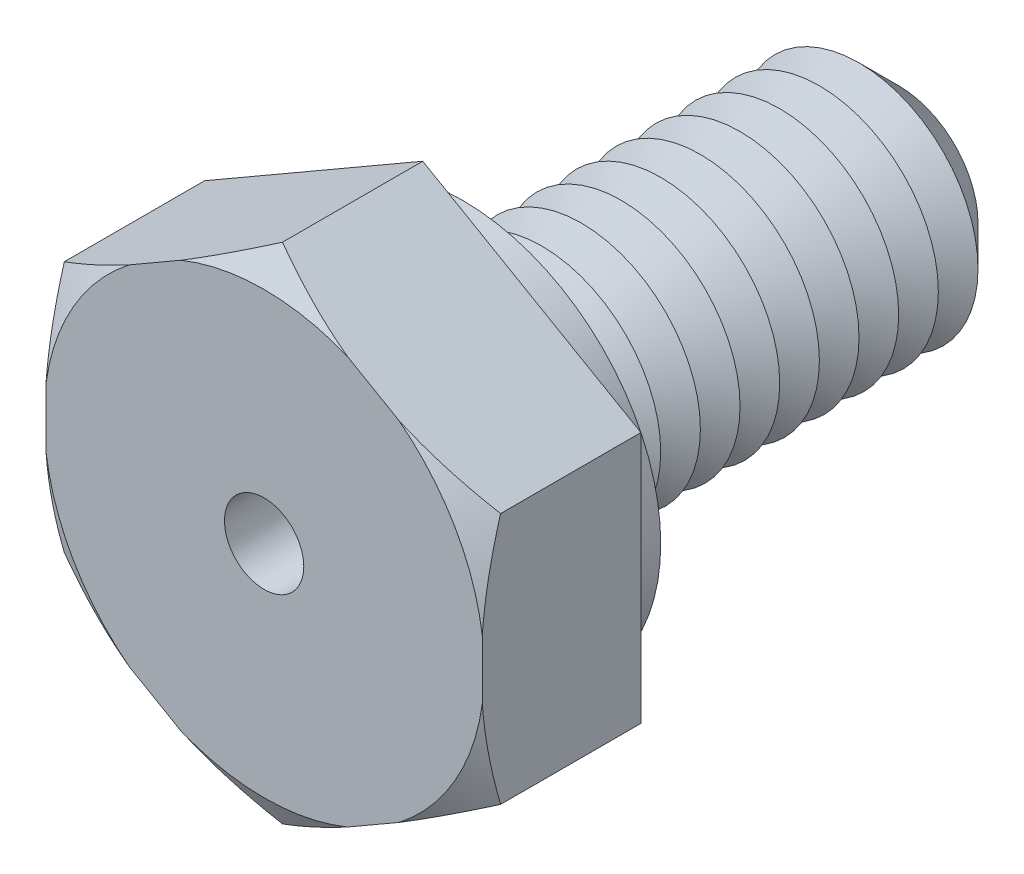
ISO-10303-21;
HEADER;
FILE_DESCRIPTION(('STEP AP214'),'2;1');
FILE_NAME('part.step','',(''),(''),'','','');
FILE_SCHEMA(('AUTOMOTIVE_DESIGN { 1 0 10303 214 1 1 1 1 }'));
ENDSEC;
DATA;
#1=APPLICATION_CONTEXT('core data for automotive mechanical design processes');
#2=APPLICATION_PROTOCOL_DEFINITION('international standard','automotive_design',2000,#1);
#3=PRODUCT_CONTEXT('',#1,'mechanical');
#4=PRODUCT('Part','Part','',(#3));
#5=PRODUCT_RELATED_PRODUCT_CATEGORY('part','',(#4));
#6=PRODUCT_DEFINITION_FORMATION('','',#4);
#7=PRODUCT_DEFINITION_CONTEXT('part definition',#1,'design');
#8=PRODUCT_DEFINITION('design','',#6,#7);
#9=PRODUCT_DEFINITION_SHAPE('','',#8);
#10=(LENGTH_UNIT() NAMED_UNIT(*) SI_UNIT(.MILLI.,.METRE.));
#11=(NAMED_UNIT(*) PLANE_ANGLE_UNIT() SI_UNIT($,.RADIAN.));
#12=(NAMED_UNIT(*) SI_UNIT($,.STERADIAN.) SOLID_ANGLE_UNIT());
#13=UNCERTAINTY_MEASURE_WITH_UNIT(LENGTH_MEASURE(1.E-05),#10,'distance_accuracy_value','');
#14=(GEOMETRIC_REPRESENTATION_CONTEXT(3) GLOBAL_UNCERTAINTY_ASSIGNED_CONTEXT((#13)) GLOBAL_UNIT_ASSIGNED_CONTEXT((#10,
#11,#12)) REPRESENTATION_CONTEXT('',''));
#15=CARTESIAN_POINT('',(0.,0.,0.));
#16=DIRECTION('',(0.,0.,1.));
#17=DIRECTION('',(1.,0.,0.));
#18=AXIS2_PLACEMENT_3D('',#15,#16,#17);
#19=CARTESIAN_POINT('',(2.75,1.58771324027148,2.));
#20=DIRECTION('',(-0.5,-0.866025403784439,0.));
#21=DIRECTION('',(0.866025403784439,-0.5,0.));
#22=AXIS2_PLACEMENT_3D('',#19,#20,#21);
#23=PLANE('',#22);
#24=CARTESIAN_POINT('',(4.66048793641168,0.484692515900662,0.897146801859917));
#25=CARTESIAN_POINT('',(4.57407924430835,0.53458059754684,0.94377821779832));
#26=CARTESIAN_POINT('',(4.48746398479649,0.584587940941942,0.989906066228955));
#27=CARTESIAN_POINT('',(4.31373297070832,0.684891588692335,1.08092005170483));
#28=CARTESIAN_POINT('',(4.22661715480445,0.735187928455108,1.12580603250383));
#29=CARTESIAN_POINT('',(4.05153903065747,0.836269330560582,1.21423144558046));
#30=CARTESIAN_POINT('',(3.96357490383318,0.887055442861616,1.25776609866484));
#31=CARTESIAN_POINT('',(3.78698874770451,0.989007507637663,1.34300583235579));
#32=CARTESIAN_POINT('',(3.69836673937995,1.04017344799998,1.38471097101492));
#33=CARTESIAN_POINT('',(3.42682968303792,1.196945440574,1.50858888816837));
#34=CARTESIAN_POINT('',(3.2426849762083,1.30326143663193,1.58723569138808));
#35=CARTESIAN_POINT('',(2.87039319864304,1.51820419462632,1.73037556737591));
#36=CARTESIAN_POINT('',(2.68225085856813,1.62682822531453,1.7948844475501));
#37=CARTESIAN_POINT('',(2.36072167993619,1.81246318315,1.88587189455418));
#38=CARTESIAN_POINT('',(2.22854222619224,1.88877702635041,1.91793719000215));
#39=CARTESIAN_POINT('',(1.9623222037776,2.04247922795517,1.96931401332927));
#40=CARTESIAN_POINT('',(1.82828230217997,2.11986720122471,1.98862999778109));
#41=CARTESIAN_POINT('',(1.56075616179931,2.27432349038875,2.0122791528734));
#42=CARTESIAN_POINT('',(1.42728171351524,2.35138499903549,2.01678452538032));
#43=CARTESIAN_POINT('',(1.16057863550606,2.50536609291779,2.01073620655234));
#44=CARTESIAN_POINT('',(1.02735002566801,2.58228566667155,2.00018134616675));
#45=CARTESIAN_POINT('',(0.804211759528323,2.71111460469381,1.97079823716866));
#46=CARTESIAN_POINT('',(0.713917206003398,2.76324618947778,1.95563842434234));
#47=CARTESIAN_POINT('',(0.534175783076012,2.86701994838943,1.91960186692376));
#48=CARTESIAN_POINT('',(0.444729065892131,2.91866203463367,1.89872411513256));
#49=CARTESIAN_POINT('',(0.266714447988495,3.02143882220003,1.85203328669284));
#50=CARTESIAN_POINT('',(0.17814764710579,3.07257288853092,1.82621469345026));
#51=CARTESIAN_POINT('',(0.0020075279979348,3.17426743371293,1.77045729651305));
#52=CARTESIAN_POINT('',(-0.08556585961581,3.22482795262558,1.74051878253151));
#53=CARTESIAN_POINT('',(-0.260818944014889,3.3260103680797,1.67685588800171));
#54=CARTESIAN_POINT('',(-0.348487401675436,3.37662577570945,1.64309053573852));
#55=CARTESIAN_POINT('',(-0.522893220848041,3.47731902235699,1.57271678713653));
#56=CARTESIAN_POINT('',(-0.609631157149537,3.52739719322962,1.53611027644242));
#57=CARTESIAN_POINT('',(-0.868655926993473,3.67694521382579,1.4228111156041));
#58=CARTESIAN_POINT('',(-1.03979736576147,3.775753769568,1.34262239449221));
#59=CARTESIAN_POINT('',(-1.26895816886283,3.90805982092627,1.23025748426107));
#60=CARTESIAN_POINT('',(-1.32802105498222,3.94215979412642,1.20084468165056));
#61=CARTESIAN_POINT('',(-1.44588766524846,4.01021011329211,1.14133764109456));
#62=CARTESIAN_POINT('',(-1.50469139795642,4.0441604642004,1.11124342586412));
#63=CARTESIAN_POINT('',(-1.67950896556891,4.14509143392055,1.02069737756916));
#64=CARTESIAN_POINT('',(-1.79518197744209,4.2118752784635,0.959363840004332));
#65=CARTESIAN_POINT('',(-1.91048793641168,4.27844720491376,0.897146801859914));
#66=B_SPLINE_CURVE_WITH_KNOTS('',3,(#24,#25,#26,#27,#28,#29,#30,#31,#32,#33,#34,#35,#36,#37,#38,
#39,#40,#41,#42,#43,#44,#45,#46,#47,#48,#49,#50,#51,#52,#53,#54,#55,#56,#57,#58,#59,#60,#61,#62,
#63,#64,#65),.UNSPECIFIED.,.F.,.F.,(4,2,2,2,2,2,2,2,2,2,2,2,2,2,2,2,2,2,2,2,4),(0.,
0.330408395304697,0.660858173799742,0.992367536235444,1.32386637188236,2.00369971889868,
2.68276903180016,3.15022294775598,3.61751337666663,4.0793510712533,4.54122461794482,
4.85714368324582,5.17311843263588,5.4894480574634,5.80575544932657,6.12584332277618,
6.44572054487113,7.08531613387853,7.30813289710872,7.5309422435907,7.97184194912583),.UNSPECIFIED.);
#67=CARTESIAN_POINT('',(2.75,1.58771324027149,1.76905989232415));
#68=VERTEX_POINT('',#67);
#69=CARTESIAN_POINT('',(1.69960608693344,2.1941584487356,2.));
#70=VERTEX_POINT('',#69);
#71=EDGE_CURVE('E132',#68,#70,#66,.T.);
#72=ORIENTED_EDGE('',*,*,#71,.F.);
#73=DIRECTION('',(0.,0.,-1.));
#74=VECTOR('',#73,1.);
#75=CARTESIAN_POINT('',(2.75,1.58771324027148,2.));
#76=LINE('',#75,#74);
#77=CARTESIAN_POINT('',(2.75,1.58771324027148,0.));
#78=VERTEX_POINT('',#77);
#79=EDGE_CURVE('E144',#68,#78,#76,.T.);
#80=ORIENTED_EDGE('',*,*,#79,.T.);
#81=DIRECTION('',(-0.866025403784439,0.5,0.));
#82=VECTOR('',#81,1.);
#83=CARTESIAN_POINT('',(2.75,1.58771324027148,0.));
#84=LINE('',#83,#82);
#85=CARTESIAN_POINT('',(0.,3.17542648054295,0.));
#86=VERTEX_POINT('',#85);
#87=EDGE_CURVE('E238',#78,#86,#84,.T.);
#88=ORIENTED_EDGE('',*,*,#87,.T.);
#89=DIRECTION('',(0.,0.,-1.));
#90=VECTOR('',#89,1.);
#91=CARTESIAN_POINT('',(0.,3.17542648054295,2.));
#92=LINE('',#91,#90);
#93=CARTESIAN_POINT('',(0.,3.17542648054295,1.76905989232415));
#94=VERTEX_POINT('',#93);
#95=EDGE_CURVE('E178',#94,#86,#92,.T.);
#96=ORIENTED_EDGE('',*,*,#95,.F.);
#97=CARTESIAN_POINT('',(1.05039391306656,2.56898127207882,2.));
#98=VERTEX_POINT('',#97);
#99=EDGE_CURVE('E151',#98,#94,#66,.T.);
#100=ORIENTED_EDGE('',*,*,#99,.F.);
#101=DIRECTION('',(-0.866025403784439,0.5,0.));
#102=VECTOR('',#101,1.);
#103=CARTESIAN_POINT('',(2.75,1.58771324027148,2.));
#104=LINE('',#103,#102);
#105=EDGE_CURVE('E148',#70,#98,#104,.T.);
#106=ORIENTED_EDGE('',*,*,#105,.F.);
#107=EDGE_LOOP('',(#72,#80,#88,#96,#100,#106));
#108=FACE_BOUND('',#107,.T.);
#109=ADVANCED_FACE('F39',(#108),#23,.F.);
#110=CARTESIAN_POINT('',(0.,3.17542648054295,2.));
#111=DIRECTION('',(0.5,-0.866025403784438,0.));
#112=DIRECTION('',(0.866025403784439,0.5,0.));
#113=AXIS2_PLACEMENT_3D('',#110,#111,#112);
#114=PLANE('',#113);
#115=CARTESIAN_POINT('',(1.91048793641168,4.27844720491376,0.897146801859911));
#116=CARTESIAN_POINT('',(1.82407924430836,4.22855912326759,0.943778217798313));
#117=CARTESIAN_POINT('',(1.7374639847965,4.17855177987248,0.989906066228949));
#118=CARTESIAN_POINT('',(1.56373297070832,4.07824813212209,1.08092005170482));
#119=CARTESIAN_POINT('',(1.47661715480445,4.02795179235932,1.12580603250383));
#120=CARTESIAN_POINT('',(1.30153903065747,3.92687039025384,1.21423144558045));
#121=CARTESIAN_POINT('',(1.21357490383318,3.87608427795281,1.25776609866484));
#122=CARTESIAN_POINT('',(1.03698874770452,3.77413221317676,1.34300583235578));
#123=CARTESIAN_POINT('',(0.948366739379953,3.72296627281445,1.38471097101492));
#124=CARTESIAN_POINT('',(0.676829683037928,3.56619428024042,1.50858888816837));
#125=CARTESIAN_POINT('',(0.492684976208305,3.4598782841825,1.58723569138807));
#126=CARTESIAN_POINT('',(0.120393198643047,3.24493552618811,1.73037556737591));
#127=CARTESIAN_POINT('',(-0.0677491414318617,3.1363114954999,1.7948844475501));
#128=CARTESIAN_POINT('',(-0.389278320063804,2.95067653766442,1.88587189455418));
#129=CARTESIAN_POINT('',(-0.521457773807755,2.87436269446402,1.91793719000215));
#130=CARTESIAN_POINT('',(-0.787677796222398,2.72066049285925,1.96931401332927));
#131=CARTESIAN_POINT('',(-0.921717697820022,2.64327251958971,1.98862999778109));
#132=CARTESIAN_POINT('',(-1.18924383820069,2.48881623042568,2.0122791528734));
#133=CARTESIAN_POINT('',(-1.32271828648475,2.41175472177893,2.01678452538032));
#134=CARTESIAN_POINT('',(-1.58942136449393,2.25777362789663,2.01073620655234));
#135=CARTESIAN_POINT('',(-1.72264997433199,2.18085405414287,2.00018134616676));
#136=CARTESIAN_POINT('',(-1.94578824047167,2.05202511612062,1.97079823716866));
#137=CARTESIAN_POINT('',(-2.03608279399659,1.99989353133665,1.95563842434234));
#138=CARTESIAN_POINT('',(-2.21582421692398,1.896119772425,1.91960186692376));
#139=CARTESIAN_POINT('',(-2.30527093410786,1.84447768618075,1.89872411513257));
#140=CARTESIAN_POINT('',(-2.48328555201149,1.7417008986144,1.85203328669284));
#141=CARTESIAN_POINT('',(-2.5718523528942,1.69056683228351,1.82621469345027));
#142=CARTESIAN_POINT('',(-2.74799247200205,1.5888722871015,1.77045729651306));
#143=CARTESIAN_POINT('',(-2.8355658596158,1.53831176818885,1.74051878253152));
#144=CARTESIAN_POINT('',(-3.01081894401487,1.43712935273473,1.67685588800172));
#145=CARTESIAN_POINT('',(-3.09848740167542,1.38651394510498,1.64309053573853));
#146=CARTESIAN_POINT('',(-3.27289322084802,1.28582069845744,1.57271678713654));
#147=CARTESIAN_POINT('',(-3.35963115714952,1.23574252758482,1.53611027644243));
#148=CARTESIAN_POINT('',(-3.61865592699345,1.08619450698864,1.42281111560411));
#149=CARTESIAN_POINT('',(-3.78979736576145,0.987385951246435,1.34262239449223));
#150=CARTESIAN_POINT('',(-4.01895816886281,0.855079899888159,1.23025748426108));
#151=CARTESIAN_POINT('',(-4.0780210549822,0.820979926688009,1.20084468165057));
#152=CARTESIAN_POINT('',(-4.19588766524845,0.752929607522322,1.14133764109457));
#153=CARTESIAN_POINT('',(-4.25469139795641,0.718979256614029,1.11124342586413));
#154=CARTESIAN_POINT('',(-4.42950896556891,0.618048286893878,1.02069737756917));
#155=CARTESIAN_POINT('',(-4.54518197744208,0.551264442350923,0.959363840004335));
#156=CARTESIAN_POINT('',(-4.66048793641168,0.484692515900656,0.897146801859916));
#157=B_SPLINE_CURVE_WITH_KNOTS('',3,(#115,#116,#117,#118,#119,#120,#121,#122,#123,#124,#125,
#126,#127,#128,#129,#130,#131,#132,#133,#134,#135,#136,#137,#138,#139,#140,#141,#142,#143,#144,
#145,#146,#147,#148,#149,#150,#151,#152,#153,#154,#155,#156),.UNSPECIFIED.,.F.,.F.,(4,2,2,2,2,2,
2,2,2,2,2,2,2,2,2,2,2,2,2,2,4),(0.,0.330408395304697,0.660858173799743,0.992367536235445,
1.32386637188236,2.00369971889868,2.68276903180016,3.15022294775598,3.61751337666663,
4.0793510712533,4.54122461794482,4.85714368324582,5.17311843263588,5.48944805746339,
5.80575544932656,6.12584332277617,6.44572054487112,7.08531613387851,7.30813289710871,
7.5309422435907,7.97184194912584),.UNSPECIFIED.);
#158=CARTESIAN_POINT('',(-1.05039391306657,2.56898127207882,2.));
#159=VERTEX_POINT('',#158);
#160=EDGE_CURVE('E352',#94,#159,#157,.T.);
#161=ORIENTED_EDGE('',*,*,#160,.F.);
#162=ORIENTED_EDGE('',*,*,#95,.T.);
#163=DIRECTION('',(-0.866025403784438,-0.5,0.));
#164=VECTOR('',#163,1.);
#165=CARTESIAN_POINT('',(0.,3.17542648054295,0.));
#166=LINE('',#165,#164);
#167=CARTESIAN_POINT('',(-2.75,1.58771324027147,0.));
#168=VERTEX_POINT('',#167);
#169=EDGE_CURVE('E241',#86,#168,#166,.T.);
#170=ORIENTED_EDGE('',*,*,#169,.T.);
#171=DIRECTION('',(0.,0.,-1.));
#172=VECTOR('',#171,1.);
#173=CARTESIAN_POINT('',(-2.75,1.58771324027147,2.));
#174=LINE('',#173,#172);
#175=CARTESIAN_POINT('',(-2.75,1.58771324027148,1.76905989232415));
#176=VERTEX_POINT('',#175);
#177=EDGE_CURVE('E175',#176,#168,#174,.T.);
#178=ORIENTED_EDGE('',*,*,#177,.F.);
#179=CARTESIAN_POINT('',(-1.69960608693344,2.1941584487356,2.));
#180=VERTEX_POINT('',#179);
#181=EDGE_CURVE('E344',#180,#176,#157,.T.);
#182=ORIENTED_EDGE('',*,*,#181,.F.);
#183=DIRECTION('',(-0.866025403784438,-0.5,0.));
#184=VECTOR('',#183,1.);
#185=CARTESIAN_POINT('',(0.,3.17542648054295,2.));
#186=LINE('',#185,#184);
#187=EDGE_CURVE('E215',#159,#180,#186,.T.);
#188=ORIENTED_EDGE('',*,*,#187,.F.);
#189=EDGE_LOOP('',(#161,#162,#170,#178,#182,#188));
#190=FACE_BOUND('',#189,.T.);
#191=ADVANCED_FACE('F358',(#190),#114,.F.);
#192=CARTESIAN_POINT('',(-2.75,1.58771324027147,2.));
#193=DIRECTION('',(1.,0.,0.));
#194=DIRECTION('',(0.,0.,-1.));
#195=AXIS2_PLACEMENT_3D('',#192,#193,#194);
#196=PLANE('',#195);
#197=CARTESIAN_POINT('',(-2.75,3.49820117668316,1.03335245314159));
#198=CARTESIAN_POINT('',(-2.75,3.3988452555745,1.07843728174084));
#199=CARTESIAN_POINT('',(-2.75,3.29921780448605,1.12293477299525));
#200=CARTESIAN_POINT('',(-2.75,3.09930320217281,1.21047025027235));
#201=CARTESIAN_POINT('',(-2.75,2.99901593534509,1.25350797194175));
#202=CARTESIAN_POINT('',(-2.75,2.79728071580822,1.33799855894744));
#203=CARTESIAN_POINT('',(-2.75,2.69582966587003,1.37944406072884));
#204=CARTESIAN_POINT('',(-2.75,2.49207131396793,1.46016516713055));
#205=CARTESIAN_POINT('',(-2.75,2.38976405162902,1.49944087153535));
#206=CARTESIAN_POINT('',(-2.75,2.18462050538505,1.57517230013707));
#207=CARTESIAN_POINT('',(-2.75,2.0817886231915,1.61163983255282));
#208=CARTESIAN_POINT('',(-2.75,1.87503931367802,1.68134876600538));
#209=CARTESIAN_POINT('',(-2.75,1.7711218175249,1.71458996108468));
#210=CARTESIAN_POINT('',(-2.75,1.45784948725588,1.80833694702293));
#211=CARTESIAN_POINT('',(-2.75,1.24663799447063,1.86299520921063));
#212=CARTESIAN_POINT('',(-2.75,0.880007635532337,1.93741428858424));
#213=CARTESIAN_POINT('',(-2.75,0.725721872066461,1.96267397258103));
#214=CARTESIAN_POINT('',(-2.75,0.415477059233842,1.99905142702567));
#215=CARTESIAN_POINT('',(-2.75,0.259518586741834,2.01017392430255));
#216=CARTESIAN_POINT('',(-2.75,-0.052664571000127,2.01694102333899));
#217=CARTESIAN_POINT('',(-2.75,-0.208889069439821,2.01259389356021));
#218=CARTESIAN_POINT('',(-2.75,-0.520179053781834,1.98898893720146));
#219=CARTESIAN_POINT('',(-2.75,-0.675244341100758,1.96972861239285));
#220=CARTESIAN_POINT('',(-2.75,-1.0603123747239,1.90556109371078));
#221=CARTESIAN_POINT('',(-2.75,-1.28896433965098,1.85264132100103));
#222=CARTESIAN_POINT('',(-2.75,-1.62776674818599,1.75827794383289));
#223=CARTESIAN_POINT('',(-2.75,-1.74015276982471,1.72427052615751));
#224=CARTESIAN_POINT('',(-2.75,-1.96362143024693,1.65220283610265));
#225=CARTESIAN_POINT('',(-2.75,-2.07470418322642,1.61414292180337));
#226=CARTESIAN_POINT('',(-2.75,-2.2969572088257,1.53431422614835));
#227=CARTESIAN_POINT('',(-2.75,-2.40811380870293,1.49250783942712));
#228=CARTESIAN_POINT('',(-2.75,-2.62938860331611,1.40621968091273));
#229=CARTESIAN_POINT('',(-2.75,-2.73950673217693,1.36173774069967));
#230=CARTESIAN_POINT('',(-2.75,-2.95816234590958,1.27090723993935));
#231=CARTESIAN_POINT('',(-2.75,-3.06670540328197,1.22457202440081));
#232=CARTESIAN_POINT('',(-2.75,-3.2830047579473,1.130169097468));
#233=CARTESIAN_POINT('',(-2.75,-3.39076124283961,1.08210181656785));
#234=CARTESIAN_POINT('',(-2.75,-3.49820117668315,1.03335245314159));
#235=B_SPLINE_CURVE_WITH_KNOTS('',3,(#197,#198,#199,#200,#201,#202,#203,#204,#205,#206,#207,
#208,#209,#210,#211,#212,#213,#214,#215,#216,#217,#218,#219,#220,#221,#222,#223,#224,#225,#226,
#227,#228,#229,#230,#231,#232,#233,#234),.UNSPECIFIED.,.F.,.F.,(4,2,2,2,2,2,2,2,2,2,2,2,2,2,2,2,
2,2,4),(0.,0.327324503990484,0.654707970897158,0.983457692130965,1.31219228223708,
1.63945907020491,1.96674673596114,2.62024190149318,3.08872929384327,3.55706000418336,
4.02514043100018,4.49329928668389,5.19584793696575,5.54806763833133,5.9002562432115,
6.25649337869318,6.61275296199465,6.96679459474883,7.32074883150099),.UNSPECIFIED.);
#236=CARTESIAN_POINT('',(-2.75,0.374822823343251,2.));
#237=VERTEX_POINT('',#236);
#238=EDGE_CURVE('E222',#176,#237,#235,.T.);
#239=ORIENTED_EDGE('',*,*,#238,.F.);
#240=ORIENTED_EDGE('',*,*,#177,.T.);
#241=DIRECTION('',(0.,-1.,0.));
#242=VECTOR('',#241,1.);
#243=CARTESIAN_POINT('',(-2.75,1.58771324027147,0.));
#244=LINE('',#243,#242);
#245=CARTESIAN_POINT('',(-2.75,-1.58771324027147,0.));
#246=VERTEX_POINT('',#245);
#247=EDGE_CURVE('E246',#168,#246,#244,.T.);
#248=ORIENTED_EDGE('',*,*,#247,.T.);
#249=DIRECTION('',(0.,0.,-1.));
#250=VECTOR('',#249,1.);
#251=CARTESIAN_POINT('',(-2.75,-1.58771324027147,2.));
#252=LINE('',#251,#250);
#253=CARTESIAN_POINT('',(-2.75000000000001,-1.58771324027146,1.76905989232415));
#254=VERTEX_POINT('',#253);
#255=EDGE_CURVE('E172',#254,#246,#252,.T.);
#256=ORIENTED_EDGE('',*,*,#255,.F.);
#257=CARTESIAN_POINT('',(-2.75,-0.374822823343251,2.));
#258=VERTEX_POINT('',#257);
#259=EDGE_CURVE('E225',#258,#254,#235,.T.);
#260=ORIENTED_EDGE('',*,*,#259,.F.);
#261=DIRECTION('',(0.,-1.,0.));
#262=VECTOR('',#261,1.);
#263=CARTESIAN_POINT('',(-2.75,1.58771324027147,2.));
#264=LINE('',#263,#262);
#265=EDGE_CURVE('E213',#237,#258,#264,.T.);
#266=ORIENTED_EDGE('',*,*,#265,.F.);
#267=EDGE_LOOP('',(#239,#240,#248,#256,#260,#266));
#268=FACE_BOUND('',#267,.T.);
#269=ADVANCED_FACE('F221',(#268),#196,.F.);
#270=CARTESIAN_POINT('',(-2.75,-1.58771324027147,2.));
#271=DIRECTION('',(0.5,0.866025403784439,0.));
#272=DIRECTION('',(-0.866025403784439,0.5,0.));
#273=AXIS2_PLACEMENT_3D('',#270,#271,#272);
#274=PLANE('',#273);
#275=CARTESIAN_POINT('',(-4.66048793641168,-0.48469251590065,0.897146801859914));
#276=CARTESIAN_POINT('',(-4.57407924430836,-0.534580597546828,0.943778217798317));
#277=CARTESIAN_POINT('',(-4.4874639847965,-0.58458794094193,0.989906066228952));
#278=CARTESIAN_POINT('',(-4.31373297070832,-0.684891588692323,1.08092005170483));
#279=CARTESIAN_POINT('',(-4.22661715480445,-0.735187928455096,1.12580603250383));
#280=CARTESIAN_POINT('',(-4.05153903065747,-0.836269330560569,1.21423144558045));
#281=CARTESIAN_POINT('',(-3.96357490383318,-0.887055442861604,1.25776609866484));
#282=CARTESIAN_POINT('',(-3.78698874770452,-0.989007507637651,1.34300583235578));
#283=CARTESIAN_POINT('',(-3.69836673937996,-1.04017344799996,1.38471097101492));
#284=CARTESIAN_POINT('',(-3.42682968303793,-1.19694544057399,1.50858888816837));
#285=CARTESIAN_POINT('',(-3.24268497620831,-1.30326143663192,1.58723569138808));
#286=CARTESIAN_POINT('',(-2.87039319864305,-1.5182041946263,1.73037556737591));
#287=CARTESIAN_POINT('',(-2.68225085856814,-1.62682822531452,1.7948844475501));
#288=CARTESIAN_POINT('',(-2.3607216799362,-1.81246318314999,1.88587189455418));
#289=CARTESIAN_POINT('',(-2.22854222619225,-1.8887770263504,1.91793719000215));
#290=CARTESIAN_POINT('',(-1.96232220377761,-2.04247922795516,1.96931401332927));
#291=CARTESIAN_POINT('',(-1.82828230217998,-2.1198672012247,1.9886299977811));
#292=CARTESIAN_POINT('',(-1.56075616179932,-2.27432349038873,2.0122791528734));
#293=CARTESIAN_POINT('',(-1.42728171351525,-2.35138499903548,2.01678452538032));
#294=CARTESIAN_POINT('',(-1.16057863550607,-2.50536609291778,2.01073620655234));
#295=CARTESIAN_POINT('',(-1.02735002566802,-2.58228566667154,2.00018134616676));
#296=CARTESIAN_POINT('',(-0.804211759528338,-2.71111460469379,1.97079823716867));
#297=CARTESIAN_POINT('',(-0.713917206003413,-2.76324618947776,1.95563842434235));
#298=CARTESIAN_POINT('',(-0.534175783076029,-2.86701994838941,1.91960186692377));
#299=CARTESIAN_POINT('',(-0.444729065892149,-2.91866203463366,1.89872411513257));
#300=CARTESIAN_POINT('',(-0.266714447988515,-3.02143882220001,1.85203328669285));
#301=CARTESIAN_POINT('',(-0.178147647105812,-3.0725728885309,1.82621469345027));
#302=CARTESIAN_POINT('',(-0.00200752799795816,-3.17426743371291,1.77045729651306));
#303=CARTESIAN_POINT('',(0.0855658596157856,-3.22482795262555,1.74051878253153));
#304=CARTESIAN_POINT('',(0.260818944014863,-3.32601036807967,1.67685588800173));
#305=CARTESIAN_POINT('',(0.348487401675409,-3.37662577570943,1.64309053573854));
#306=CARTESIAN_POINT('',(0.522893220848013,-3.47731902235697,1.57271678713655));
#307=CARTESIAN_POINT('',(0.609631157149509,-3.52739719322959,1.53611027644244));
#308=CARTESIAN_POINT('',(0.868655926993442,-3.67694521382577,1.42281111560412));
#309=CARTESIAN_POINT('',(1.03979736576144,-3.77575376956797,1.34262239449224));
#310=CARTESIAN_POINT('',(1.26895816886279,-3.90805982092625,1.23025748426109));
#311=CARTESIAN_POINT('',(1.32802105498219,-3.9421597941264,1.20084468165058));
#312=CARTESIAN_POINT('',(1.44588766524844,-4.01021011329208,1.14133764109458));
#313=CARTESIAN_POINT('',(1.5046913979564,-4.04416046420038,1.11124342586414));
#314=CARTESIAN_POINT('',(1.6795089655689,-4.14509143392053,1.02069737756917));
#315=CARTESIAN_POINT('',(1.79518197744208,-4.21187527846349,0.959363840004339));
#316=CARTESIAN_POINT('',(1.91048793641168,-4.27844720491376,0.897146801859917));
#317=B_SPLINE_CURVE_WITH_KNOTS('',3,(#275,#276,#277,#278,#279,#280,#281,#282,#283,#284,#285,
#286,#287,#288,#289,#290,#291,#292,#293,#294,#295,#296,#297,#298,#299,#300,#301,#302,#303,#304,
#305,#306,#307,#308,#309,#310,#311,#312,#313,#314,#315,#316),.UNSPECIFIED.,.F.,.F.,(4,2,2,2,2,2,
2,2,2,2,2,2,2,2,2,2,2,2,2,2,4),(0.,0.330408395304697,0.660858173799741,0.992367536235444,
1.32386637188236,2.00369971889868,2.68276903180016,3.15022294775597,3.61751337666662,
4.0793510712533,4.54122461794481,4.85714368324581,5.17311843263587,5.48944805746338,
5.80575544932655,6.12584332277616,6.44572054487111,7.08531613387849,7.3081328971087,
7.53094224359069,7.97184194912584),.UNSPECIFIED.);
#318=CARTESIAN_POINT('',(-1.69960608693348,-2.19415844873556,2.));
#319=VERTEX_POINT('',#318);
#320=EDGE_CURVE('E395',#254,#319,#317,.T.);
#321=ORIENTED_EDGE('',*,*,#320,.F.);
#322=ORIENTED_EDGE('',*,*,#255,.T.);
#323=DIRECTION('',(0.866025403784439,-0.5,0.));
#324=VECTOR('',#323,1.);
#325=CARTESIAN_POINT('',(-2.75,-1.58771324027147,0.));
#326=LINE('',#325,#324);
#327=CARTESIAN_POINT('',(0.,-3.17542648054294,0.));
#328=VERTEX_POINT('',#327);
#329=EDGE_CURVE('E250',#246,#328,#326,.T.);
#330=ORIENTED_EDGE('',*,*,#329,.T.);
#331=DIRECTION('',(0.,0.,-1.));
#332=VECTOR('',#331,1.);
#333=CARTESIAN_POINT('',(0.,-3.17542648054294,2.));
#334=LINE('',#333,#332);
#335=CARTESIAN_POINT('',(0.,-3.17542648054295,1.76905989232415));
#336=VERTEX_POINT('',#335);
#337=EDGE_CURVE('E162',#336,#328,#334,.T.);
#338=ORIENTED_EDGE('',*,*,#337,.F.);
#339=CARTESIAN_POINT('',(-1.05039391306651,-2.56898127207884,2.));
#340=VERTEX_POINT('',#339);
#341=EDGE_CURVE('E389',#340,#336,#317,.T.);
#342=ORIENTED_EDGE('',*,*,#341,.F.);
#343=DIRECTION('',(0.866025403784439,-0.5,0.));
#344=VECTOR('',#343,1.);
#345=CARTESIAN_POINT('',(-2.75,-1.58771324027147,2.));
#346=LINE('',#345,#344);
#347=EDGE_CURVE('E227',#319,#340,#346,.T.);
#348=ORIENTED_EDGE('',*,*,#347,.F.);
#349=EDGE_LOOP('',(#321,#322,#330,#338,#342,#348));
#350=FACE_BOUND('',#349,.T.);
#351=ADVANCED_FACE('F396',(#350),#274,.F.);
#352=CARTESIAN_POINT('',(0.,-3.17542648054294,2.));
#353=DIRECTION('',(-0.5,0.866025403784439,0.));
#354=DIRECTION('',(-0.866025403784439,-0.5,0.));
#355=AXIS2_PLACEMENT_3D('',#352,#353,#354);
#356=PLANE('',#355);
#357=CARTESIAN_POINT('',(-1.91048793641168,-4.27844720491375,0.897146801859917));
#358=CARTESIAN_POINT('',(-1.82407924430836,-4.22855912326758,0.94377821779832));
#359=CARTESIAN_POINT('',(-1.73746398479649,-4.17855177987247,0.989906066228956));
#360=CARTESIAN_POINT('',(-1.56373297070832,-4.07824813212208,1.08092005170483));
#361=CARTESIAN_POINT('',(-1.47661715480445,-4.02795179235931,1.12580603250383));
#362=CARTESIAN_POINT('',(-1.30153903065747,-3.92687039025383,1.21423144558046));
#363=CARTESIAN_POINT('',(-1.21357490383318,-3.8760842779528,1.25776609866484));
#364=CARTESIAN_POINT('',(-1.03698874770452,-3.77413221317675,1.34300583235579));
#365=CARTESIAN_POINT('',(-0.948366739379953,-3.72296627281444,1.38471097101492));
#366=CARTESIAN_POINT('',(-0.676829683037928,-3.56619428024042,1.50858888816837));
#367=CARTESIAN_POINT('',(-0.492684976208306,-3.45987828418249,1.58723569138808));
#368=CARTESIAN_POINT('',(-0.120393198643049,-3.2449355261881,1.73037556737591));
#369=CARTESIAN_POINT('',(0.0677491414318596,-3.13631149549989,1.7948844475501));
#370=CARTESIAN_POINT('',(0.389278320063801,-2.95067653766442,1.88587189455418));
#371=CARTESIAN_POINT('',(0.521457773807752,-2.87436269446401,1.91793719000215));
#372=CARTESIAN_POINT('',(0.787677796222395,-2.72066049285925,1.96931401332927));
#373=CARTESIAN_POINT('',(0.921717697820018,-2.64327251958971,1.9886299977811));
#374=CARTESIAN_POINT('',(1.18924383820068,-2.48881623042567,2.0122791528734));
#375=CARTESIAN_POINT('',(1.32271828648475,-2.41175472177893,2.01678452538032));
#376=CARTESIAN_POINT('',(1.58942136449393,-2.25777362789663,2.01073620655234));
#377=CARTESIAN_POINT('',(1.72264997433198,-2.18085405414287,2.00018134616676));
#378=CARTESIAN_POINT('',(1.94578824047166,-2.05202511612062,1.97079823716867));
#379=CARTESIAN_POINT('',(2.03608279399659,-1.99989353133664,1.95563842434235));
#380=CARTESIAN_POINT('',(2.21582421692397,-1.89611977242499,1.91960186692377));
#381=CARTESIAN_POINT('',(2.30527093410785,-1.84447768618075,1.89872411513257));
#382=CARTESIAN_POINT('',(2.48328555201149,-1.7417008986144,1.85203328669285));
#383=CARTESIAN_POINT('',(2.57185235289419,-1.69056683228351,1.82621469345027));
#384=CARTESIAN_POINT('',(2.74799247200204,-1.58887228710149,1.77045729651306));
#385=CARTESIAN_POINT('',(2.83556585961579,-1.53831176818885,1.74051878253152));
#386=CARTESIAN_POINT('',(3.01081894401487,-1.43712935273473,1.67685588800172));
#387=CARTESIAN_POINT('',(3.09848740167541,-1.38651394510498,1.64309053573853));
#388=CARTESIAN_POINT('',(3.27289322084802,-1.28582069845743,1.57271678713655));
#389=CARTESIAN_POINT('',(3.35963115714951,-1.23574252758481,1.53611027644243));
#390=CARTESIAN_POINT('',(3.61865592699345,-1.08619450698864,1.42281111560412));
#391=CARTESIAN_POINT('',(3.78979736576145,-0.987385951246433,1.34262239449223));
#392=CARTESIAN_POINT('',(4.0189581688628,-0.855079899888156,1.23025748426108));
#393=CARTESIAN_POINT('',(4.0780210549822,-0.820979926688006,1.20084468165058));
#394=CARTESIAN_POINT('',(4.19588766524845,-0.752929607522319,1.14133764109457));
#395=CARTESIAN_POINT('',(4.2546913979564,-0.718979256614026,1.11124342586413));
#396=CARTESIAN_POINT('',(4.4295089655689,-0.618048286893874,1.02069737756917));
#397=CARTESIAN_POINT('',(4.54518197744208,-0.551264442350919,0.959363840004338));
#398=CARTESIAN_POINT('',(4.66048793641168,-0.484692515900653,0.897146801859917));
#399=B_SPLINE_CURVE_WITH_KNOTS('',3,(#357,#358,#359,#360,#361,#362,#363,#364,#365,#366,#367,
#368,#369,#370,#371,#372,#373,#374,#375,#376,#377,#378,#379,#380,#381,#382,#383,#384,#385,#386,
#387,#388,#389,#390,#391,#392,#393,#394,#395,#396,#397,#398),.UNSPECIFIED.,.F.,.F.,(4,2,2,2,2,2,
2,2,2,2,2,2,2,2,2,2,2,2,2,2,4),(0.,0.330408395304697,0.660858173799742,0.992367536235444,
1.32386637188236,2.00369971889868,2.68276903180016,3.15022294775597,3.61751337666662,
4.0793510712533,4.54122461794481,4.85714368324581,5.17311843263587,5.48944805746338,
5.80575544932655,6.12584332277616,6.44572054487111,7.0853161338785,7.3081328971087,
7.53094224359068,7.97184194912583),.UNSPECIFIED.);
#400=CARTESIAN_POINT('',(1.05039391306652,-2.56898127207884,2.));
#401=VERTEX_POINT('',#400);
#402=EDGE_CURVE('E64',#336,#401,#399,.T.);
#403=ORIENTED_EDGE('',*,*,#402,.F.);
#404=ORIENTED_EDGE('',*,*,#337,.T.);
#405=DIRECTION('',(0.866025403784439,0.5,0.));
#406=VECTOR('',#405,1.);
#407=CARTESIAN_POINT('',(0.,-3.17542648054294,0.));
#408=LINE('',#407,#406);
#409=CARTESIAN_POINT('',(2.75,-1.58771324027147,0.));
#410=VERTEX_POINT('',#409);
#411=EDGE_CURVE('E253',#328,#410,#408,.T.);
#412=ORIENTED_EDGE('',*,*,#411,.T.);
#413=DIRECTION('',(0.,0.,-1.));
#414=VECTOR('',#413,1.);
#415=CARTESIAN_POINT('',(2.75,-1.58771324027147,2.));
#416=LINE('',#415,#414);
#417=CARTESIAN_POINT('',(2.75,-1.58771324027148,1.76905989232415));
#418=VERTEX_POINT('',#417);
#419=EDGE_CURVE('E157',#418,#410,#416,.T.);
#420=ORIENTED_EDGE('',*,*,#419,.F.);
#421=CARTESIAN_POINT('',(1.69960608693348,-2.19415844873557,2.));
#422=VERTEX_POINT('',#421);
#423=EDGE_CURVE('E384',#422,#418,#399,.T.);
#424=ORIENTED_EDGE('',*,*,#423,.F.);
#425=DIRECTION('',(0.866025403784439,0.5,0.));
#426=VECTOR('',#425,1.);
#427=CARTESIAN_POINT('',(0.,-3.17542648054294,2.));
#428=LINE('',#427,#426);
#429=EDGE_CURVE('E165',#401,#422,#428,.T.);
#430=ORIENTED_EDGE('',*,*,#429,.F.);
#431=EDGE_LOOP('',(#403,#404,#412,#420,#424,#430));
#432=FACE_BOUND('',#431,.T.);
#433=ADVANCED_FACE('F399',(#432),#356,.F.);
#434=CARTESIAN_POINT('',(2.75,-1.58771324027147,2.));
#435=DIRECTION('',(-1.,0.,0.));
#436=DIRECTION('',(0.,-1.,0.));
#437=AXIS2_PLACEMENT_3D('',#434,#435,#436);
#438=PLANE('',#437);
#439=CARTESIAN_POINT('',(2.75,-3.49820117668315,1.03335245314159));
#440=CARTESIAN_POINT('',(2.75,-3.3988452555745,1.07843728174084));
#441=CARTESIAN_POINT('',(2.75,-3.29921780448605,1.12293477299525));
#442=CARTESIAN_POINT('',(2.75,-3.0993032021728,1.21047025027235));
#443=CARTESIAN_POINT('',(2.75,-2.99901593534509,1.25350797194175));
#444=CARTESIAN_POINT('',(2.75,-2.79728071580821,1.33799855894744));
#445=CARTESIAN_POINT('',(2.75,-2.69582966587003,1.37944406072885));
#446=CARTESIAN_POINT('',(2.75,-2.49207131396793,1.46016516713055));
#447=CARTESIAN_POINT('',(2.75,-2.38976405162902,1.49944087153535));
#448=CARTESIAN_POINT('',(2.75,-2.18462050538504,1.57517230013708));
#449=CARTESIAN_POINT('',(2.75,-2.08178862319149,1.61163983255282));
#450=CARTESIAN_POINT('',(2.75,-1.87503931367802,1.68134876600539));
#451=CARTESIAN_POINT('',(2.75,-1.77112181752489,1.71458996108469));
#452=CARTESIAN_POINT('',(2.75,-1.45784948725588,1.80833694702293));
#453=CARTESIAN_POINT('',(2.75,-1.24663799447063,1.86299520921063));
#454=CARTESIAN_POINT('',(2.75,-0.880007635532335,1.93741428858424));
#455=CARTESIAN_POINT('',(2.75,-0.72572187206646,1.96267397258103));
#456=CARTESIAN_POINT('',(2.75,-0.41547705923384,1.99905142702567));
#457=CARTESIAN_POINT('',(2.75,-0.259518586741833,2.01017392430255));
#458=CARTESIAN_POINT('',(2.75,0.052664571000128,2.01694102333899));
#459=CARTESIAN_POINT('',(2.75,0.208889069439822,2.01259389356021));
#460=CARTESIAN_POINT('',(2.75,0.520179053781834,1.98898893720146));
#461=CARTESIAN_POINT('',(2.75,0.675244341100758,1.96972861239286));
#462=CARTESIAN_POINT('',(2.75,1.0603123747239,1.90556109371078));
#463=CARTESIAN_POINT('',(2.75,1.28896433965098,1.85264132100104));
#464=CARTESIAN_POINT('',(2.75,1.627766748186,1.75827794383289));
#465=CARTESIAN_POINT('',(2.75,1.74015276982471,1.72427052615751));
#466=CARTESIAN_POINT('',(2.75,1.96362143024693,1.65220283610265));
#467=CARTESIAN_POINT('',(2.75,2.07470418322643,1.61414292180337));
#468=CARTESIAN_POINT('',(2.75,2.2969572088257,1.53431422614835));
#469=CARTESIAN_POINT('',(2.75,2.40811380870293,1.49250783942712));
#470=CARTESIAN_POINT('',(2.75,2.62938860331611,1.40621968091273));
#471=CARTESIAN_POINT('',(2.75,2.73950673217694,1.36173774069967));
#472=CARTESIAN_POINT('',(2.75,2.95816234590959,1.27090723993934));
#473=CARTESIAN_POINT('',(2.75,3.06670540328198,1.22457202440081));
#474=CARTESIAN_POINT('',(2.75,3.28300475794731,1.130169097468));
#475=CARTESIAN_POINT('',(2.75,3.39076124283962,1.08210181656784));
#476=CARTESIAN_POINT('',(2.75,3.49820117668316,1.03335245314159));
#477=B_SPLINE_CURVE_WITH_KNOTS('',3,(#439,#440,#441,#442,#443,#444,#445,#446,#447,#448,#449,
#450,#451,#452,#453,#454,#455,#456,#457,#458,#459,#460,#461,#462,#463,#464,#465,#466,#467,#468,
#469,#470,#471,#472,#473,#474,#475,#476),.UNSPECIFIED.,.F.,.F.,(4,2,2,2,2,2,2,2,2,2,2,2,2,2,2,2,
2,2,4),(0.,0.327324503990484,0.654707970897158,0.983457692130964,1.31219228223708,
1.63945907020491,1.96674673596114,2.62024190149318,3.08872929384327,3.55706000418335,
4.02514043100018,4.49329928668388,5.19584793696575,5.54806763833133,5.9002562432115,
6.25649337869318,6.61275296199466,6.96679459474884,7.320748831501),.UNSPECIFIED.);
#478=CARTESIAN_POINT('',(2.75,-0.374822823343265,2.));
#479=VERTEX_POINT('',#478);
#480=EDGE_CURVE('E56',#418,#479,#477,.T.);
#481=ORIENTED_EDGE('',*,*,#480,.F.);
#482=ORIENTED_EDGE('',*,*,#419,.T.);
#483=DIRECTION('',(0.,1.,0.));
#484=VECTOR('',#483,1.);
#485=CARTESIAN_POINT('',(2.75,-1.58771324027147,0.));
#486=LINE('',#485,#484);
#487=EDGE_CURVE('E154',#410,#78,#486,.T.);
#488=ORIENTED_EDGE('',*,*,#487,.T.);
#489=ORIENTED_EDGE('',*,*,#79,.F.);
#490=CARTESIAN_POINT('',(2.75,0.374822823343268,2.));
#491=VERTEX_POINT('',#490);
#492=EDGE_CURVE('E129',#491,#68,#477,.T.);
#493=ORIENTED_EDGE('',*,*,#492,.F.);
#494=DIRECTION('',(0.,1.,0.));
#495=VECTOR('',#494,1.);
#496=CARTESIAN_POINT('',(2.75,-1.58771324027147,2.));
#497=LINE('',#496,#495);
#498=EDGE_CURVE('E158',#479,#491,#497,.T.);
#499=ORIENTED_EDGE('',*,*,#498,.F.);
#500=EDGE_LOOP('',(#481,#482,#488,#489,#493,#499));
#501=FACE_BOUND('',#500,.T.);
#502=ADVANCED_FACE('F152',(#501),#438,.F.);
#503=CARTESIAN_POINT('',(0.,0.,2.));
#504=DIRECTION('',(0.,0.,1.));
#505=DIRECTION('',(1.,0.,0.));
#506=AXIS2_PLACEMENT_3D('',#503,#504,#505);
#507=PLANE('',#506);
#508=CARTESIAN_POINT('',(0.,0.,2.));
#509=DIRECTION('',(0.,0.,1.));
#510=DIRECTION('',(1.,0.,0.));
#511=AXIS2_PLACEMENT_3D('',#508,#509,#510);
#512=CIRCLE('',#511,0.5);
#513=CARTESIAN_POINT('',(0.5,0.,2.));
#514=VERTEX_POINT('',#513);
#515=EDGE_CURVE('E795',#514,#514,#512,.T.);
#516=ORIENTED_EDGE('',*,*,#515,.F.);
#517=EDGE_LOOP('',(#516));
#518=FACE_BOUND('',#517,.T.);
#519=ORIENTED_EDGE('',*,*,#498,.T.);
#520=CARTESIAN_POINT('',(0.,0.,2.));
#521=DIRECTION('',(0.,0.,1.));
#522=DIRECTION('',(1.,0.,0.));
#523=AXIS2_PLACEMENT_3D('',#520,#521,#522);
#524=CIRCLE('',#523,2.77542648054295);
#525=EDGE_CURVE('E134',#491,#70,#524,.T.);
#526=ORIENTED_EDGE('',*,*,#525,.T.);
#527=ORIENTED_EDGE('',*,*,#105,.T.);
#528=CARTESIAN_POINT('',(0.,0.,2.));
#529=DIRECTION('',(0.,0.,1.));
#530=DIRECTION('',(1.,0.,0.));
#531=AXIS2_PLACEMENT_3D('',#528,#529,#530);
#532=CIRCLE('',#531,2.77542648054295);
#533=EDGE_CURVE('E11',#98,#159,#532,.T.);
#534=ORIENTED_EDGE('',*,*,#533,.T.);
#535=ORIENTED_EDGE('',*,*,#187,.T.);
#536=EDGE_CURVE('E49',#180,#237,#532,.T.);
#537=ORIENTED_EDGE('',*,*,#536,.T.);
#538=ORIENTED_EDGE('',*,*,#265,.T.);
#539=EDGE_CURVE('E197',#258,#319,#532,.T.);
#540=ORIENTED_EDGE('',*,*,#539,.T.);
#541=ORIENTED_EDGE('',*,*,#347,.T.);
#542=EDGE_CURVE('E192',#340,#401,#532,.T.);
#543=ORIENTED_EDGE('',*,*,#542,.T.);
#544=ORIENTED_EDGE('',*,*,#429,.T.);
#545=EDGE_CURVE('E43',#422,#479,#532,.T.);
#546=ORIENTED_EDGE('',*,*,#545,.T.);
#547=EDGE_LOOP('',(#519,#526,#527,#534,#535,#537,#538,#540,#541,#543,#544,#546));
#548=FACE_BOUND('',#547,.T.);
#549=ADVANCED_FACE('F212',(#518,#548),#507,.T.);
#550=CARTESIAN_POINT('',(0.,0.,0.));
#551=DIRECTION('',(0.,0.,1.));
#552=DIRECTION('',(1.,0.,0.));
#553=AXIS2_PLACEMENT_3D('',#550,#551,#552);
#554=PLANE('',#553);
#555=CARTESIAN_POINT('',(0.,0.,0.));
#556=DIRECTION('',(0.,0.,1.));
#557=DIRECTION('',(1.,0.,0.));
#558=AXIS2_PLACEMENT_3D('',#555,#556,#557);
#559=CIRCLE('',#558,2.5);
#560=CARTESIAN_POINT('',(2.5,0.,0.));
#561=VERTEX_POINT('',#560);
#562=EDGE_CURVE('E181',#561,#561,#559,.F.);
#563=ORIENTED_EDGE('',*,*,#562,.F.);
#564=EDGE_LOOP('',(#563));
#565=FACE_BOUND('',#564,.T.);
#566=ORIENTED_EDGE('',*,*,#87,.F.);
#567=ORIENTED_EDGE('',*,*,#487,.F.);
#568=ORIENTED_EDGE('',*,*,#411,.F.);
#569=ORIENTED_EDGE('',*,*,#329,.F.);
#570=ORIENTED_EDGE('',*,*,#247,.F.);
#571=ORIENTED_EDGE('',*,*,#169,.F.);
#572=EDGE_LOOP('',(#566,#567,#568,#569,#570,#571));
#573=FACE_BOUND('',#572,.T.);
#574=ADVANCED_FACE('F443',(#565,#573),#554,.F.);
#575=CARTESIAN_POINT('',(0.,0.,-0.5));
#576=DIRECTION('',(0.,0.,1.));
#577=DIRECTION('',(1.,0.,0.));
#578=AXIS2_PLACEMENT_3D('',#575,#576,#577);
#579=CYLINDRICAL_SURFACE('',#578,2.5);
#580=CARTESIAN_POINT('',(0.,0.,-0.5));
#581=DIRECTION('',(0.,0.,-1.));
#582=DIRECTION('',(-1.,0.,0.));
#583=AXIS2_PLACEMENT_3D('',#580,#581,#582);
#584=CIRCLE('',#583,2.5);
#585=CARTESIAN_POINT('',(-2.5,0.,-0.5));
#586=VERTEX_POINT('',#585);
#587=EDGE_CURVE('E242',#586,#586,#584,.T.);
#588=ORIENTED_EDGE('',*,*,#587,.F.);
#589=EDGE_LOOP('',(#588));
#590=FACE_BOUND('',#589,.T.);
#591=ORIENTED_EDGE('',*,*,#562,.T.);
#592=EDGE_LOOP('',(#591));
#593=FACE_BOUND('',#592,.T.);
#594=ADVANCED_FACE('F454',(#590,#593),#579,.T.);
#595=CARTESIAN_POINT('',(0.,0.,-0.5));
#596=DIRECTION('',(0.,0.,-1.));
#597=DIRECTION('',(-1.,0.,0.));
#598=AXIS2_PLACEMENT_3D('',#595,#596,#597);
#599=PLANE('',#598);
#600=CARTESIAN_POINT('',(0.,0.,-0.5));
#601=DIRECTION('',(0.,0.,1.));
#602=DIRECTION('',(1.,0.,0.));
#603=AXIS2_PLACEMENT_3D('',#600,#601,#602);
#604=CIRCLE('',#603,1.5);
#605=CARTESIAN_POINT('',(1.5,0.,-0.5));
#606=VERTEX_POINT('',#605);
#607=EDGE_CURVE('E266',#606,#606,#604,.T.);
#608=ORIENTED_EDGE('',*,*,#607,.T.);
#609=EDGE_LOOP('',(#608));
#610=FACE_BOUND('',#609,.T.);
#611=ORIENTED_EDGE('',*,*,#587,.T.);
#612=EDGE_LOOP('',(#611));
#613=FACE_BOUND('',#612,.T.);
#614=ADVANCED_FACE('F463',(#610,#613),#599,.T.);
#615=CARTESIAN_POINT('',(0.,0.,-0.5));
#616=DIRECTION('',(0.,0.,1.));
#617=DIRECTION('',(1.,0.,0.));
#618=AXIS2_PLACEMENT_3D('',#615,#616,#617);
#619=CONICAL_SURFACE('',#618,1.5,1.0471975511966);
#620=CARTESIAN_POINT('',(0.,0.,-0.75));
#621=DIRECTION('',(0.,0.,1.));
#622=DIRECTION('',(1.,0.,0.));
#623=AXIS2_PLACEMENT_3D('',#620,#621,#622);
#624=CIRCLE('',#623,1.06698729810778);
#625=CARTESIAN_POINT('',(1.06698729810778,0.,-0.75));
#626=VERTEX_POINT('',#625);
#627=EDGE_CURVE('E270',#626,#626,#624,.T.);
#628=ORIENTED_EDGE('',*,*,#627,.T.);
#629=EDGE_LOOP('',(#628));
#630=FACE_BOUND('',#629,.T.);
#631=ORIENTED_EDGE('',*,*,#607,.F.);
#632=EDGE_LOOP('',(#631));
#633=FACE_BOUND('',#632,.T.);
#634=ADVANCED_FACE('F472',(#630,#633),#619,.T.);
#635=CARTESIAN_POINT('',(0.,0.,-0.75));
#636=DIRECTION('',(0.,0.,-1.));
#637=DIRECTION('',(-1.,0.,0.));
#638=AXIS2_PLACEMENT_3D('',#635,#636,#637);
#639=CONICAL_SURFACE('',#638,1.06698729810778,1.0471975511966);
#640=CARTESIAN_POINT('',(0.,0.,-1.));
#641=DIRECTION('',(0.,0.,1.));
#642=DIRECTION('',(1.,0.,0.));
#643=AXIS2_PLACEMENT_3D('',#640,#641,#642);
#644=CIRCLE('',#643,1.5);
#645=CARTESIAN_POINT('',(1.5,0.,-1.));
#646=VERTEX_POINT('',#645);
#647=EDGE_CURVE('E274',#646,#646,#644,.T.);
#648=ORIENTED_EDGE('',*,*,#647,.T.);
#649=EDGE_LOOP('',(#648));
#650=FACE_BOUND('',#649,.T.);
#651=ORIENTED_EDGE('',*,*,#627,.F.);
#652=EDGE_LOOP('',(#651));
#653=FACE_BOUND('',#652,.T.);
#654=ADVANCED_FACE('F482',(#650,#653),#639,.T.);
#655=CARTESIAN_POINT('',(0.,0.,-1.));
#656=DIRECTION('',(0.,0.,1.));
#657=DIRECTION('',(1.,0.,0.));
#658=AXIS2_PLACEMENT_3D('',#655,#656,#657);
#659=CONICAL_SURFACE('',#658,1.5,1.0471975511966);
#660=CARTESIAN_POINT('',(0.,0.,-1.25));
#661=DIRECTION('',(0.,0.,1.));
#662=DIRECTION('',(1.,0.,0.));
#663=AXIS2_PLACEMENT_3D('',#660,#661,#662);
#664=CIRCLE('',#663,1.06698729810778);
#665=CARTESIAN_POINT('',(1.06698729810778,0.,-1.25));
#666=VERTEX_POINT('',#665);
#667=EDGE_CURVE('E278',#666,#666,#664,.T.);
#668=ORIENTED_EDGE('',*,*,#667,.T.);
#669=EDGE_LOOP('',(#668));
#670=FACE_BOUND('',#669,.T.);
#671=ORIENTED_EDGE('',*,*,#647,.F.);
#672=EDGE_LOOP('',(#671));
#673=FACE_BOUND('',#672,.T.);
#674=ADVANCED_FACE('F491',(#670,#673),#659,.T.);
#675=CARTESIAN_POINT('',(0.,0.,-1.25));
#676=DIRECTION('',(0.,0.,-1.));
#677=DIRECTION('',(-1.,0.,0.));
#678=AXIS2_PLACEMENT_3D('',#675,#676,#677);
#679=CONICAL_SURFACE('',#678,1.06698729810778,1.0471975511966);
#680=CARTESIAN_POINT('',(0.,0.,-1.5));
#681=DIRECTION('',(0.,0.,1.));
#682=DIRECTION('',(1.,0.,0.));
#683=AXIS2_PLACEMENT_3D('',#680,#681,#682);
#684=CIRCLE('',#683,1.5);
#685=CARTESIAN_POINT('',(1.5,0.,-1.5));
#686=VERTEX_POINT('',#685);
#687=EDGE_CURVE('E281',#686,#686,#684,.T.);
#688=ORIENTED_EDGE('',*,*,#687,.T.);
#689=EDGE_LOOP('',(#688));
#690=FACE_BOUND('',#689,.T.);
#691=ORIENTED_EDGE('',*,*,#667,.F.);
#692=EDGE_LOOP('',(#691));
#693=FACE_BOUND('',#692,.T.);
#694=ADVANCED_FACE('F500',(#690,#693),#679,.T.);
#695=CARTESIAN_POINT('',(0.,0.,-1.5));
#696=DIRECTION('',(0.,0.,1.));
#697=DIRECTION('',(1.,0.,0.));
#698=AXIS2_PLACEMENT_3D('',#695,#696,#697);
#699=CONICAL_SURFACE('',#698,1.5,1.0471975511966);
#700=CARTESIAN_POINT('',(0.,0.,-1.75));
#701=DIRECTION('',(0.,0.,1.));
#702=DIRECTION('',(1.,0.,0.));
#703=AXIS2_PLACEMENT_3D('',#700,#701,#702);
#704=CIRCLE('',#703,1.06698729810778);
#705=CARTESIAN_POINT('',(1.06698729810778,0.,-1.75));
#706=VERTEX_POINT('',#705);
#707=EDGE_CURVE('E284',#706,#706,#704,.T.);
#708=ORIENTED_EDGE('',*,*,#707,.T.);
#709=EDGE_LOOP('',(#708));
#710=FACE_BOUND('',#709,.T.);
#711=ORIENTED_EDGE('',*,*,#687,.F.);
#712=EDGE_LOOP('',(#711));
#713=FACE_BOUND('',#712,.T.);
#714=ADVANCED_FACE('F509',(#710,#713),#699,.T.);
#715=CARTESIAN_POINT('',(0.,0.,-1.75));
#716=DIRECTION('',(0.,0.,-1.));
#717=DIRECTION('',(-1.,0.,0.));
#718=AXIS2_PLACEMENT_3D('',#715,#716,#717);
#719=CONICAL_SURFACE('',#718,1.06698729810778,1.0471975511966);
#720=CARTESIAN_POINT('',(0.,0.,-2.));
#721=DIRECTION('',(0.,0.,1.));
#722=DIRECTION('',(1.,0.,0.));
#723=AXIS2_PLACEMENT_3D('',#720,#721,#722);
#724=CIRCLE('',#723,1.5);
#725=CARTESIAN_POINT('',(1.5,0.,-2.));
#726=VERTEX_POINT('',#725);
#727=EDGE_CURVE('E288',#726,#726,#724,.T.);
#728=ORIENTED_EDGE('',*,*,#727,.T.);
#729=EDGE_LOOP('',(#728));
#730=FACE_BOUND('',#729,.T.);
#731=ORIENTED_EDGE('',*,*,#707,.F.);
#732=EDGE_LOOP('',(#731));
#733=FACE_BOUND('',#732,.T.);
#734=ADVANCED_FACE('F518',(#730,#733),#719,.T.);
#735=CARTESIAN_POINT('',(0.,0.,-2.));
#736=DIRECTION('',(0.,0.,1.));
#737=DIRECTION('',(1.,0.,0.));
#738=AXIS2_PLACEMENT_3D('',#735,#736,#737);
#739=CONICAL_SURFACE('',#738,1.5,1.0471975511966);
#740=CARTESIAN_POINT('',(0.,0.,-2.25));
#741=DIRECTION('',(0.,0.,1.));
#742=DIRECTION('',(1.,0.,0.));
#743=AXIS2_PLACEMENT_3D('',#740,#741,#742);
#744=CIRCLE('',#743,1.06698729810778);
#745=CARTESIAN_POINT('',(1.06698729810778,0.,-2.25));
#746=VERTEX_POINT('',#745);
#747=EDGE_CURVE('E291',#746,#746,#744,.T.);
#748=ORIENTED_EDGE('',*,*,#747,.T.);
#749=EDGE_LOOP('',(#748));
#750=FACE_BOUND('',#749,.T.);
#751=ORIENTED_EDGE('',*,*,#727,.F.);
#752=EDGE_LOOP('',(#751));
#753=FACE_BOUND('',#752,.T.);
#754=ADVANCED_FACE('F527',(#750,#753),#739,.T.);
#755=CARTESIAN_POINT('',(0.,0.,-2.25));
#756=DIRECTION('',(0.,0.,-1.));
#757=DIRECTION('',(-1.,0.,0.));
#758=AXIS2_PLACEMENT_3D('',#755,#756,#757);
#759=CONICAL_SURFACE('',#758,1.06698729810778,1.0471975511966);
#760=CARTESIAN_POINT('',(0.,0.,-2.5));
#761=DIRECTION('',(0.,0.,1.));
#762=DIRECTION('',(1.,0.,0.));
#763=AXIS2_PLACEMENT_3D('',#760,#761,#762);
#764=CIRCLE('',#763,1.5);
#765=CARTESIAN_POINT('',(1.5,0.,-2.5));
#766=VERTEX_POINT('',#765);
#767=EDGE_CURVE('E295',#766,#766,#764,.T.);
#768=ORIENTED_EDGE('',*,*,#767,.T.);
#769=EDGE_LOOP('',(#768));
#770=FACE_BOUND('',#769,.T.);
#771=ORIENTED_EDGE('',*,*,#747,.F.);
#772=EDGE_LOOP('',(#771));
#773=FACE_BOUND('',#772,.T.);
#774=ADVANCED_FACE('F536',(#770,#773),#759,.T.);
#775=CARTESIAN_POINT('',(0.,0.,-2.5));
#776=DIRECTION('',(0.,0.,1.));
#777=DIRECTION('',(1.,0.,0.));
#778=AXIS2_PLACEMENT_3D('',#775,#776,#777);
#779=CONICAL_SURFACE('',#778,1.5,1.0471975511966);
#780=CARTESIAN_POINT('',(0.,0.,-2.75));
#781=DIRECTION('',(0.,0.,1.));
#782=DIRECTION('',(1.,0.,0.));
#783=AXIS2_PLACEMENT_3D('',#780,#781,#782);
#784=CIRCLE('',#783,1.06698729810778);
#785=CARTESIAN_POINT('',(1.06698729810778,0.,-2.75));
#786=VERTEX_POINT('',#785);
#787=EDGE_CURVE('E299',#786,#786,#784,.T.);
#788=ORIENTED_EDGE('',*,*,#787,.T.);
#789=EDGE_LOOP('',(#788));
#790=FACE_BOUND('',#789,.T.);
#791=ORIENTED_EDGE('',*,*,#767,.F.);
#792=EDGE_LOOP('',(#791));
#793=FACE_BOUND('',#792,.T.);
#794=ADVANCED_FACE('F545',(#790,#793),#779,.T.);
#795=CARTESIAN_POINT('',(0.,0.,-2.75));
#796=DIRECTION('',(0.,0.,-1.));
#797=DIRECTION('',(-1.,0.,0.));
#798=AXIS2_PLACEMENT_3D('',#795,#796,#797);
#799=CONICAL_SURFACE('',#798,1.06698729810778,1.0471975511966);
#800=CARTESIAN_POINT('',(0.,0.,-3.));
#801=DIRECTION('',(0.,0.,1.));
#802=DIRECTION('',(1.,0.,0.));
#803=AXIS2_PLACEMENT_3D('',#800,#801,#802);
#804=CIRCLE('',#803,1.5);
#805=CARTESIAN_POINT('',(1.5,0.,-3.));
#806=VERTEX_POINT('',#805);
#807=EDGE_CURVE('E303',#806,#806,#804,.T.);
#808=ORIENTED_EDGE('',*,*,#807,.T.);
#809=EDGE_LOOP('',(#808));
#810=FACE_BOUND('',#809,.T.);
#811=ORIENTED_EDGE('',*,*,#787,.F.);
#812=EDGE_LOOP('',(#811));
#813=FACE_BOUND('',#812,.T.);
#814=ADVANCED_FACE('F554',(#810,#813),#799,.T.);
#815=CARTESIAN_POINT('',(0.,0.,-3.));
#816=DIRECTION('',(0.,0.,1.));
#817=DIRECTION('',(1.,0.,0.));
#818=AXIS2_PLACEMENT_3D('',#815,#816,#817);
#819=CONICAL_SURFACE('',#818,1.5,1.0471975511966);
#820=CARTESIAN_POINT('',(0.,0.,-3.25));
#821=DIRECTION('',(0.,0.,1.));
#822=DIRECTION('',(1.,0.,0.));
#823=AXIS2_PLACEMENT_3D('',#820,#821,#822);
#824=CIRCLE('',#823,1.06698729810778);
#825=CARTESIAN_POINT('',(1.06698729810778,0.,-3.25));
#826=VERTEX_POINT('',#825);
#827=EDGE_CURVE('E307',#826,#826,#824,.T.);
#828=ORIENTED_EDGE('',*,*,#827,.T.);
#829=EDGE_LOOP('',(#828));
#830=FACE_BOUND('',#829,.T.);
#831=ORIENTED_EDGE('',*,*,#807,.F.);
#832=EDGE_LOOP('',(#831));
#833=FACE_BOUND('',#832,.T.);
#834=ADVANCED_FACE('F563',(#830,#833),#819,.T.);
#835=CARTESIAN_POINT('',(0.,0.,-3.25));
#836=DIRECTION('',(0.,0.,-1.));
#837=DIRECTION('',(-1.,0.,0.));
#838=AXIS2_PLACEMENT_3D('',#835,#836,#837);
#839=CONICAL_SURFACE('',#838,1.06698729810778,1.0471975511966);
#840=CARTESIAN_POINT('',(0.,0.,-3.5));
#841=DIRECTION('',(0.,0.,1.));
#842=DIRECTION('',(1.,0.,0.));
#843=AXIS2_PLACEMENT_3D('',#840,#841,#842);
#844=CIRCLE('',#843,1.5);
#845=CARTESIAN_POINT('',(1.5,0.,-3.5));
#846=VERTEX_POINT('',#845);
#847=EDGE_CURVE('E311',#846,#846,#844,.T.);
#848=ORIENTED_EDGE('',*,*,#847,.T.);
#849=EDGE_LOOP('',(#848));
#850=FACE_BOUND('',#849,.T.);
#851=ORIENTED_EDGE('',*,*,#827,.F.);
#852=EDGE_LOOP('',(#851));
#853=FACE_BOUND('',#852,.T.);
#854=ADVANCED_FACE('F572',(#850,#853),#839,.T.);
#855=CARTESIAN_POINT('',(0.,0.,-3.5));
#856=DIRECTION('',(0.,0.,1.));
#857=DIRECTION('',(1.,0.,0.));
#858=AXIS2_PLACEMENT_3D('',#855,#856,#857);
#859=CONICAL_SURFACE('',#858,1.5,1.0471975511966);
#860=CARTESIAN_POINT('',(0.,0.,-3.75));
#861=DIRECTION('',(0.,0.,1.));
#862=DIRECTION('',(1.,0.,0.));
#863=AXIS2_PLACEMENT_3D('',#860,#861,#862);
#864=CIRCLE('',#863,1.06698729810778);
#865=CARTESIAN_POINT('',(1.06698729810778,0.,-3.75));
#866=VERTEX_POINT('',#865);
#867=EDGE_CURVE('E315',#866,#866,#864,.T.);
#868=ORIENTED_EDGE('',*,*,#867,.T.);
#869=EDGE_LOOP('',(#868));
#870=FACE_BOUND('',#869,.T.);
#871=ORIENTED_EDGE('',*,*,#847,.F.);
#872=EDGE_LOOP('',(#871));
#873=FACE_BOUND('',#872,.T.);
#874=ADVANCED_FACE('F581',(#870,#873),#859,.T.);
#875=CARTESIAN_POINT('',(0.,0.,-3.75));
#876=DIRECTION('',(0.,0.,-1.));
#877=DIRECTION('',(-1.,0.,0.));
#878=AXIS2_PLACEMENT_3D('',#875,#876,#877);
#879=CONICAL_SURFACE('',#878,1.06698729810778,1.0471975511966);
#880=CARTESIAN_POINT('',(0.,0.,-4.));
#881=DIRECTION('',(0.,0.,1.));
#882=DIRECTION('',(1.,0.,0.));
#883=AXIS2_PLACEMENT_3D('',#880,#881,#882);
#884=CIRCLE('',#883,1.5);
#885=CARTESIAN_POINT('',(1.5,0.,-4.));
#886=VERTEX_POINT('',#885);
#887=EDGE_CURVE('E318',#886,#886,#884,.T.);
#888=ORIENTED_EDGE('',*,*,#887,.T.);
#889=EDGE_LOOP('',(#888));
#890=FACE_BOUND('',#889,.T.);
#891=ORIENTED_EDGE('',*,*,#867,.F.);
#892=EDGE_LOOP('',(#891));
#893=FACE_BOUND('',#892,.T.);
#894=ADVANCED_FACE('F590',(#890,#893),#879,.T.);
#895=CARTESIAN_POINT('',(0.,0.,-4.));
#896=DIRECTION('',(0.,0.,1.));
#897=DIRECTION('',(1.,0.,0.));
#898=AXIS2_PLACEMENT_3D('',#895,#896,#897);
#899=CONICAL_SURFACE('',#898,1.5,1.0471975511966);
#900=CARTESIAN_POINT('',(0.,0.,-4.25));
#901=DIRECTION('',(0.,0.,1.));
#902=DIRECTION('',(1.,0.,0.));
#903=AXIS2_PLACEMENT_3D('',#900,#901,#902);
#904=CIRCLE('',#903,1.06698729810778);
#905=CARTESIAN_POINT('',(1.06698729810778,0.,-4.25));
#906=VERTEX_POINT('',#905);
#907=EDGE_CURVE('E322',#906,#906,#904,.T.);
#908=ORIENTED_EDGE('',*,*,#907,.T.);
#909=EDGE_LOOP('',(#908));
#910=FACE_BOUND('',#909,.T.);
#911=ORIENTED_EDGE('',*,*,#887,.F.);
#912=EDGE_LOOP('',(#911));
#913=FACE_BOUND('',#912,.T.);
#914=ADVANCED_FACE('F599',(#910,#913),#899,.T.);
#915=CARTESIAN_POINT('',(0.,0.,-4.25));
#916=DIRECTION('',(0.,0.,-1.));
#917=DIRECTION('',(-1.,0.,0.));
#918=AXIS2_PLACEMENT_3D('',#915,#916,#917);
#919=CONICAL_SURFACE('',#918,1.06698729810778,1.0471975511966);
#920=CARTESIAN_POINT('',(0.,0.,-4.5));
#921=DIRECTION('',(0.,0.,1.));
#922=DIRECTION('',(1.,0.,0.));
#923=AXIS2_PLACEMENT_3D('',#920,#921,#922);
#924=CIRCLE('',#923,1.5);
#925=CARTESIAN_POINT('',(1.5,0.,-4.5));
#926=VERTEX_POINT('',#925);
#927=EDGE_CURVE('E326',#926,#926,#924,.T.);
#928=ORIENTED_EDGE('',*,*,#927,.T.);
#929=EDGE_LOOP('',(#928));
#930=FACE_BOUND('',#929,.T.);
#931=ORIENTED_EDGE('',*,*,#907,.F.);
#932=EDGE_LOOP('',(#931));
#933=FACE_BOUND('',#932,.T.);
#934=ADVANCED_FACE('F608',(#930,#933),#919,.T.);
#935=CARTESIAN_POINT('',(0.,0.,-4.5));
#936=DIRECTION('',(0.,0.,1.));
#937=DIRECTION('',(1.,0.,0.));
#938=AXIS2_PLACEMENT_3D('',#935,#936,#937);
#939=CONICAL_SURFACE('',#938,1.5,1.0471975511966);
#940=CARTESIAN_POINT('',(0.,0.,-4.75));
#941=DIRECTION('',(0.,0.,1.));
#942=DIRECTION('',(1.,0.,0.));
#943=AXIS2_PLACEMENT_3D('',#940,#941,#942);
#944=CIRCLE('',#943,1.06698729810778);
#945=CARTESIAN_POINT('',(1.06698729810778,0.,-4.75));
#946=VERTEX_POINT('',#945);
#947=EDGE_CURVE('E330',#946,#946,#944,.T.);
#948=ORIENTED_EDGE('',*,*,#947,.T.);
#949=EDGE_LOOP('',(#948));
#950=FACE_BOUND('',#949,.T.);
#951=ORIENTED_EDGE('',*,*,#927,.F.);
#952=EDGE_LOOP('',(#951));
#953=FACE_BOUND('',#952,.T.);
#954=ADVANCED_FACE('F617',(#950,#953),#939,.T.);
#955=CARTESIAN_POINT('',(0.,0.,-4.75));
#956=DIRECTION('',(0.,0.,-1.));
#957=DIRECTION('',(-1.,0.,0.));
#958=AXIS2_PLACEMENT_3D('',#955,#956,#957);
#959=CONICAL_SURFACE('',#958,1.06698729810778,1.0471975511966);
#960=CARTESIAN_POINT('',(0.,0.,-5.));
#961=DIRECTION('',(0.,0.,1.));
#962=DIRECTION('',(1.,0.,0.));
#963=AXIS2_PLACEMENT_3D('',#960,#961,#962);
#964=CIRCLE('',#963,1.5);
#965=CARTESIAN_POINT('',(1.5,0.,-5.));
#966=VERTEX_POINT('',#965);
#967=EDGE_CURVE('E334',#966,#966,#964,.T.);
#968=ORIENTED_EDGE('',*,*,#967,.T.);
#969=EDGE_LOOP('',(#968));
#970=FACE_BOUND('',#969,.T.);
#971=ORIENTED_EDGE('',*,*,#947,.F.);
#972=EDGE_LOOP('',(#971));
#973=FACE_BOUND('',#972,.T.);
#974=ADVANCED_FACE('F626',(#970,#973),#959,.T.);
#975=CARTESIAN_POINT('',(0.,0.,-5.));
#976=DIRECTION('',(0.,0.,1.));
#977=DIRECTION('',(1.,0.,0.));
#978=AXIS2_PLACEMENT_3D('',#975,#976,#977);
#979=CONICAL_SURFACE('',#978,1.5,1.0471975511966);
#980=CARTESIAN_POINT('',(0.,0.,-5.25));
#981=DIRECTION('',(0.,0.,1.));
#982=DIRECTION('',(1.,0.,0.));
#983=AXIS2_PLACEMENT_3D('',#980,#981,#982);
#984=CIRCLE('',#983,1.06698729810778);
#985=CARTESIAN_POINT('',(1.06698729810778,0.,-5.25));
#986=VERTEX_POINT('',#985);
#987=EDGE_CURVE('E337',#986,#986,#984,.T.);
#988=ORIENTED_EDGE('',*,*,#987,.T.);
#989=EDGE_LOOP('',(#988));
#990=FACE_BOUND('',#989,.T.);
#991=ORIENTED_EDGE('',*,*,#967,.F.);
#992=EDGE_LOOP('',(#991));
#993=FACE_BOUND('',#992,.T.);
#994=ADVANCED_FACE('F635',(#990,#993),#979,.T.);
#995=CARTESIAN_POINT('',(0.,0.,-5.25));
#996=DIRECTION('',(0.,0.,-1.));
#997=DIRECTION('',(-1.,0.,0.));
#998=AXIS2_PLACEMENT_3D('',#995,#996,#997);
#999=CONICAL_SURFACE('',#998,1.06698729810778,1.0471975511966);
#1000=CARTESIAN_POINT('',(0.,0.,-5.5));
#1001=DIRECTION('',(0.,0.,1.));
#1002=DIRECTION('',(1.,0.,0.));
#1003=AXIS2_PLACEMENT_3D('',#1000,#1001,#1002);
#1004=CIRCLE('',#1003,1.5);
#1005=CARTESIAN_POINT('',(1.5,0.,-5.5));
#1006=VERTEX_POINT('',#1005);
#1007=EDGE_CURVE('E340',#1006,#1006,#1004,.T.);
#1008=ORIENTED_EDGE('',*,*,#1007,.T.);
#1009=EDGE_LOOP('',(#1008));
#1010=FACE_BOUND('',#1009,.T.);
#1011=ORIENTED_EDGE('',*,*,#987,.F.);
#1012=EDGE_LOOP('',(#1011));
#1013=FACE_BOUND('',#1012,.T.);
#1014=ADVANCED_FACE('F368',(#1010,#1013),#999,.T.);
#1015=CARTESIAN_POINT('',(0.,0.,-6.));
#1016=DIRECTION('',(0.,0.,-1.));
#1017=DIRECTION('',(-1.,0.,0.));
#1018=AXIS2_PLACEMENT_3D('',#1015,#1016,#1017);
#1019=PLANE('',#1018);
#1020=CARTESIAN_POINT('',(0.,0.,-6.));
#1021=DIRECTION('',(0.,0.,-1.));
#1022=DIRECTION('',(-1.,0.,0.));
#1023=AXIS2_PLACEMENT_3D('',#1020,#1021,#1022);
#1024=CIRCLE('',#1023,0.5);
#1025=CARTESIAN_POINT('',(-0.5,0.,-6.));
#1026=VERTEX_POINT('',#1025);
#1027=EDGE_CURVE('E798',#1026,#1026,#1024,.F.);
#1028=ORIENTED_EDGE('',*,*,#1027,.T.);
#1029=EDGE_LOOP('',(#1028));
#1030=FACE_BOUND('',#1029,.T.);
#1031=CARTESIAN_POINT('',(0.,0.,-6.));
#1032=DIRECTION('',(0.,0.,-1.));
#1033=DIRECTION('',(-1.,0.,0.));
#1034=AXIS2_PLACEMENT_3D('',#1031,#1032,#1033);
#1035=CIRCLE('',#1034,1.);
#1036=CARTESIAN_POINT('',(-1.,0.,-6.));
#1037=VERTEX_POINT('',#1036);
#1038=EDGE_CURVE('E184',#1037,#1037,#1035,.T.);
#1039=ORIENTED_EDGE('',*,*,#1038,.T.);
#1040=EDGE_LOOP('',(#1039));
#1041=FACE_BOUND('',#1040,.T.);
#1042=ADVANCED_FACE('F651',(#1030,#1041),#1019,.T.);
#1043=CARTESIAN_POINT('',(0.,0.,-6.));
#1044=DIRECTION('',(0.,0.,1.));
#1045=DIRECTION('',(1.,0.,0.));
#1046=AXIS2_PLACEMENT_3D('',#1043,#1044,#1045);
#1047=CONICAL_SURFACE('',#1046,1.,0.785398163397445);
#1048=ORIENTED_EDGE('',*,*,#1007,.F.);
#1049=EDGE_LOOP('',(#1048));
#1050=FACE_BOUND('',#1049,.T.);
#1051=ORIENTED_EDGE('',*,*,#1038,.F.);
#1052=EDGE_LOOP('',(#1051));
#1053=FACE_BOUND('',#1052,.T.);
#1054=ADVANCED_FACE('F41',(#1050,#1053),#1047,.T.);
#1055=CARTESIAN_POINT('',(0.,0.,2.));
#1056=DIRECTION('',(0.,0.,-1.));
#1057=DIRECTION('',(-1.,0.,0.));
#1058=AXIS2_PLACEMENT_3D('',#1055,#1056,#1057);
#1059=CONICAL_SURFACE('',#1058,2.77542648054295,1.0471975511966);
#1060=ORIENTED_EDGE('',*,*,#423,.T.);
#1061=ORIENTED_EDGE('',*,*,#480,.T.);
#1062=ORIENTED_EDGE('',*,*,#545,.F.);
#1063=EDGE_LOOP('',(#1060,#1061,#1062));
#1064=FACE_BOUND('',#1063,.T.);
#1065=ADVANCED_FACE('F666',(#1064),#1059,.T.);
#1066=ORIENTED_EDGE('',*,*,#341,.T.);
#1067=ORIENTED_EDGE('',*,*,#402,.T.);
#1068=ORIENTED_EDGE('',*,*,#542,.F.);
#1069=EDGE_LOOP('',(#1066,#1067,#1068));
#1070=FACE_BOUND('',#1069,.T.);
#1071=ADVANCED_FACE('F673',(#1070),#1059,.T.);
#1072=ORIENTED_EDGE('',*,*,#259,.T.);
#1073=ORIENTED_EDGE('',*,*,#320,.T.);
#1074=ORIENTED_EDGE('',*,*,#539,.F.);
#1075=EDGE_LOOP('',(#1072,#1073,#1074));
#1076=FACE_BOUND('',#1075,.T.);
#1077=ADVANCED_FACE('F680',(#1076),#1059,.T.);
#1078=ORIENTED_EDGE('',*,*,#181,.T.);
#1079=ORIENTED_EDGE('',*,*,#238,.T.);
#1080=ORIENTED_EDGE('',*,*,#536,.F.);
#1081=EDGE_LOOP('',(#1078,#1079,#1080));
#1082=FACE_BOUND('',#1081,.T.);
#1083=ADVANCED_FACE('F365',(#1082),#1059,.T.);
#1084=ORIENTED_EDGE('',*,*,#99,.T.);
#1085=ORIENTED_EDGE('',*,*,#160,.T.);
#1086=ORIENTED_EDGE('',*,*,#533,.F.);
#1087=EDGE_LOOP('',(#1084,#1085,#1086));
#1088=FACE_BOUND('',#1087,.T.);
#1089=ADVANCED_FACE('F360',(#1088),#1059,.T.);
#1090=ORIENTED_EDGE('',*,*,#71,.T.);
#1091=ORIENTED_EDGE('',*,*,#525,.F.);
#1092=ORIENTED_EDGE('',*,*,#492,.T.);
#1093=EDGE_LOOP('',(#1090,#1091,#1092));
#1094=FACE_BOUND('',#1093,.T.);
#1095=ADVANCED_FACE('F131',(#1094),#1059,.T.);
#1096=CARTESIAN_POINT('',(0.,0.,-7.41421356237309));
#1097=DIRECTION('',(0.,0.,1.));
#1098=DIRECTION('',(1.,0.,0.));
#1099=AXIS2_PLACEMENT_3D('',#1096,#1097,#1098);
#1100=CYLINDRICAL_SURFACE('',#1099,0.5);
#1101=ORIENTED_EDGE('',*,*,#515,.T.);
#1102=EDGE_LOOP('',(#1101));
#1103=FACE_BOUND('',#1102,.T.);
#1104=ORIENTED_EDGE('',*,*,#1027,.F.);
#1105=EDGE_LOOP('',(#1104));
#1106=FACE_BOUND('',#1105,.T.);
#1107=ADVANCED_FACE('F367',(#1103,#1106),#1100,.F.);
#1108=CLOSED_SHELL('',(#109,#191,#269,#351,#433,#502,#549,#574,#594,#614,#634,#654,#674,#694,
#714,#734,#754,#774,#794,#814,#834,#854,#874,#894,#914,#934,#954,#974,#994,#1014,#1042,#1054,
#1065,#1071,#1077,#1083,#1089,#1095,#1107));
#1109=MANIFOLD_SOLID_BREP('B2',#1108);
#1110=ADVANCED_BREP_SHAPE_REPRESENTATION('',(#18,#1109),#14);
#1111=SHAPE_DEFINITION_REPRESENTATION(#9,#1110);
ENDSEC;
END-ISO-10303-21;
